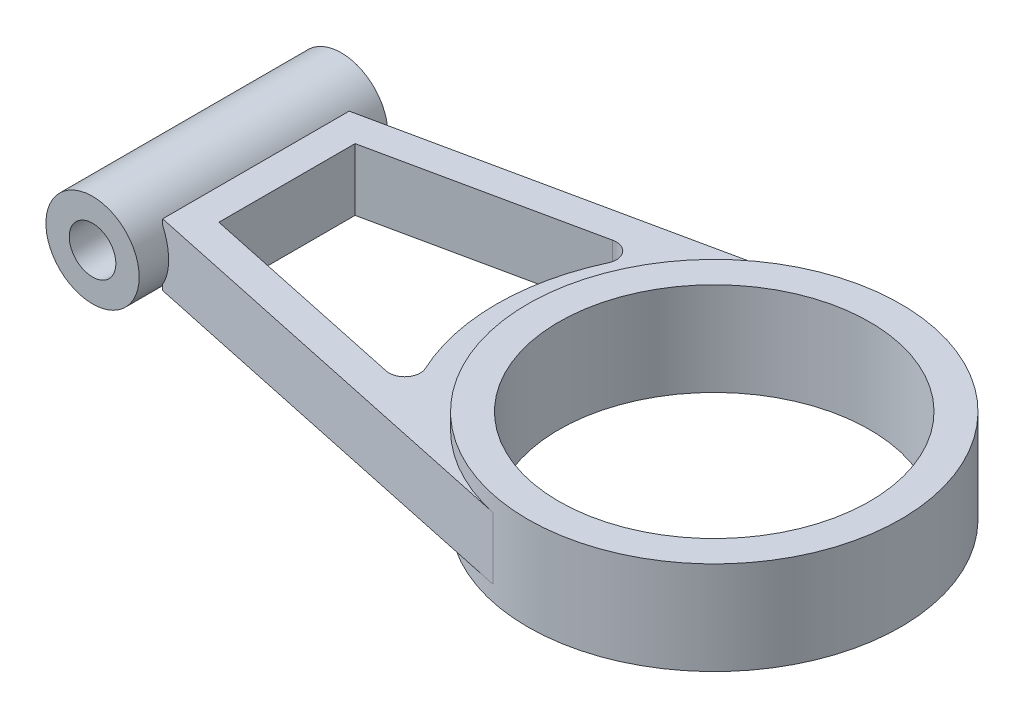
from build123d import *

# Parameters (mm, degrees)
CROQUIS2_R              = 50
SALIENTE_EXTRUIR3_DEPTH = 30
CORTAR_EXTRUIR1_DEPTH   = 5
CORTAR_EXTRUIR2_START   = -5
CORTAR_EXTRUIR2_DEPTH   = 5
CROQUIS7_R              = 15
SALIENTE_EXTRUIR4_DEPTH = 40
SALIENTE_EXTRUIR5_START = -40
CROQUIS7_2_R            = 15
SALIENTE_EXTRUIR5_DEPTH = 40
CROQUIS8_R              = 7.5
CORTAR_EXTRUIR3_DEPTH   = 204.776838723


with BuildPart() as part:
    # Croquis2 → Saliente-Extruir3 (new body)
    with BuildSketch(Plane(origin=(0, 0, 0), x_dir=(1, 0, 0), z_dir=(0, 1, 0))):
        with BuildLine():
            Line((-147.4451574, 30), (-12.474701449, 58.688856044))
            ThreePointArc((-12.474701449, 58.688856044), (60, 0), (-12.474701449, -58.688856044))
            Line((-12.474701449, -58.688856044), (-147.4451574, -30))
            Line((-147.4451574, -30), (-147.4451574, 30))
        make_face()
        with Locations(Location((0, 0, 0), (0, 0, 270))):
            Circle(CROQUIS2_R, mode=Mode.SUBTRACT)
        with BuildLine():
            Line((-137.4451574, -21.902159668), (-69.084440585, -36.432678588))
            ThreePointArc((-69.084440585, -36.432678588), (-64.13537775, -34.658954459), (-63.508556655, -29.439144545))
            ThreePointArc((-63.508556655, -29.439144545), (-70, 0), (-63.508556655, 29.439144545))
            ThreePointArc((-63.508556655, 29.439144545), (-64.13537775, 34.658954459), (-69.084440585, 36.432678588))
            Line((-69.084440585, 36.432678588), (-137.4451574, 21.902159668))
            Line((-137.4451574, 21.902159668), (-137.4451574, -21.902159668))
        make_face(mode=Mode.SUBTRACT)
    extrude(amount=SALIENTE_EXTRUIR3_DEPTH)

    # Croquis4 → Cortar-Extruir1 (cut)
    with BuildSketch(Plane(origin=(0, 0, 0), x_dir=(1, 0, 0), z_dir=(0, 1, 0))):
        with BuildLine():
            Line((-147.4451574, -30), (-12.474701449, -58.688856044))
            ThreePointArc((-12.474701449, -58.688856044), (-60, 0), (-12.474701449, 58.688856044))
            Line((-12.474701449, 58.688856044), (-147.4451574, 30))
            Line((-147.4451574, 30), (-147.4451574, -30))
        make_face()
        with BuildLine():
            Line((-69.084440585, 36.432678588), (-137.4451574, 21.902159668))
            Line((-137.4451574, 21.902159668), (-137.4451574, -21.902159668))
            Line((-137.4451574, -21.902159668), (-69.084440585, -36.432678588))
            ThreePointArc((-69.084440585, -36.432678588), (-64.13537775, -34.658954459), (-63.508556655, -29.439144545))
            ThreePointArc((-63.508556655, -29.439144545), (-70, 0), (-63.508556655, 29.439144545))
            ThreePointArc((-63.508556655, 29.439144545), (-64.13537775, 34.658954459), (-69.084440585, 36.432678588))
        make_face(mode=Mode.SUBTRACT)
    extrude(amount=CORTAR_EXTRUIR1_DEPTH, mode=Mode.SUBTRACT)

    # Croquis5 → Cortar-Extruir2 (cut)
    with BuildSketch(Plane(origin=(0, 30, 0), x_dir=(1, 0, 0), z_dir=(0, 1, 0)).offset(CORTAR_EXTRUIR2_START)):
        with BuildLine():
            Line((-147.4451574, 30), (-147.4451574, -30))
            Line((-147.4451574, -30), (-12.474701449, -58.688856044))
            ThreePointArc((-12.474701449, -58.688856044), (-60, 0), (-12.474701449, 58.688856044))
            Line((-12.474701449, 58.688856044), (-147.4451574, 30))
        make_face()
        with BuildLine():
            Line((-137.4451574, -21.902159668), (-69.084440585, -36.432678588))
            ThreePointArc((-69.084440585, -36.432678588), (-64.13537775, -34.658954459), (-63.508556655, -29.439144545))
            ThreePointArc((-63.508556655, -29.439144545), (-70, 0), (-63.508556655, 29.439144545))
            ThreePointArc((-63.508556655, 29.439144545), (-64.13537775, 34.658954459), (-69.084440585, 36.432678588))
            Line((-69.084440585, 36.432678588), (-137.4451574, 21.902159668))
            Line((-137.4451574, 21.902159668), (-137.4451574, -21.902159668))
        make_face(mode=Mode.SUBTRACT)
    extrude(amount=CORTAR_EXTRUIR2_DEPTH, mode=Mode.SUBTRACT)

    # Croquis7 → Saliente-Extruir4 (add)
    with BuildSketch(Plane.XY):
        with Locations(Location((-160, 15, 0), (0, 0, 326.823571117))):
            Circle(CROQUIS7_R)
    extrude(amount=SALIENTE_EXTRUIR4_DEPTH)

    # Croquis7_2 → Saliente-Extruir5 (add)
    with BuildSketch(Plane.XY.offset(SALIENTE_EXTRUIR5_START)):
        with Locations((-160, 15)):
            Circle(CROQUIS7_2_R)
    extrude(amount=SALIENTE_EXTRUIR5_DEPTH)

    # Croquis8 → Cortar-Extruir3 (cut, through all)
    with BuildSketch(Plane.XY.offset(40)):
        with Locations((-160, 15)):
            Circle(CROQUIS8_R)
    extrude(amount=-CORTAR_EXTRUIR3_DEPTH, mode=Mode.SUBTRACT)


solid = part.part
